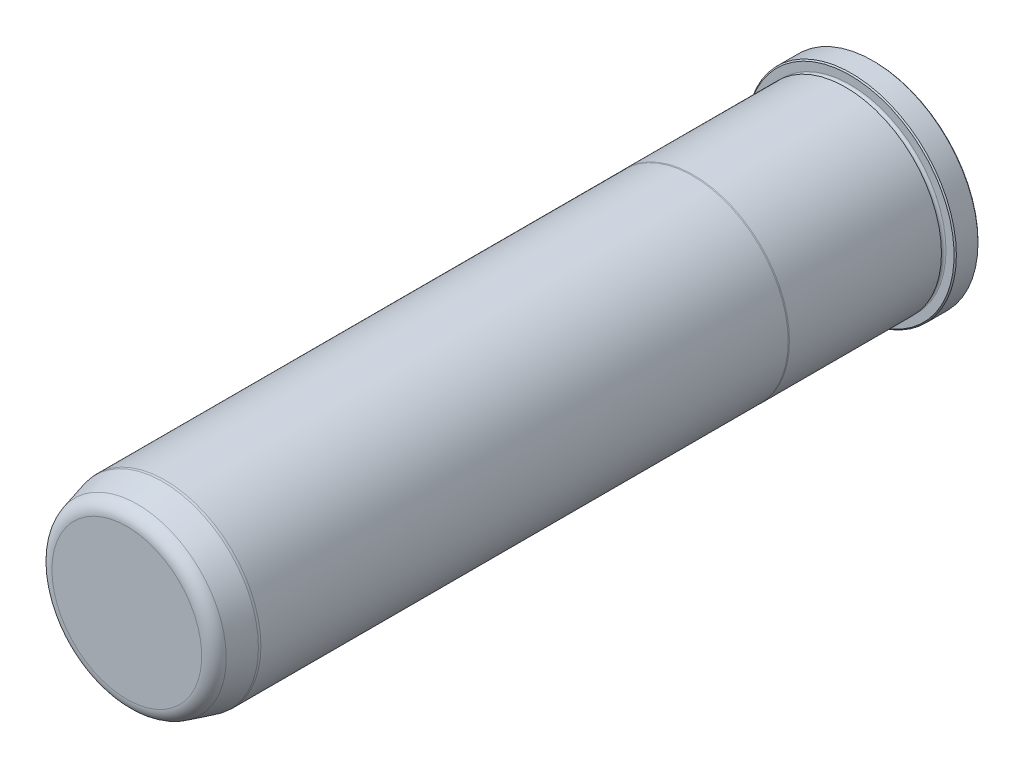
ISO-10303-21;
HEADER;
FILE_DESCRIPTION(('STEP AP214'),'2;1');
FILE_NAME('part.step','',(''),(''),'','','');
FILE_SCHEMA(('AUTOMOTIVE_DESIGN { 1 0 10303 214 1 1 1 1 }'));
ENDSEC;
DATA;
#1=APPLICATION_CONTEXT('core data for automotive mechanical design processes');
#2=APPLICATION_PROTOCOL_DEFINITION('international standard','automotive_design',2000,#1);
#3=PRODUCT_CONTEXT('',#1,'mechanical');
#4=PRODUCT('Part','Part','',(#3));
#5=PRODUCT_RELATED_PRODUCT_CATEGORY('part','',(#4));
#6=PRODUCT_DEFINITION_FORMATION('','',#4);
#7=PRODUCT_DEFINITION_CONTEXT('part definition',#1,'design');
#8=PRODUCT_DEFINITION('design','',#6,#7);
#9=PRODUCT_DEFINITION_SHAPE('','',#8);
#10=(LENGTH_UNIT() NAMED_UNIT(*) SI_UNIT(.MILLI.,.METRE.));
#11=(NAMED_UNIT(*) PLANE_ANGLE_UNIT() SI_UNIT($,.RADIAN.));
#12=(NAMED_UNIT(*) SI_UNIT($,.STERADIAN.) SOLID_ANGLE_UNIT());
#13=UNCERTAINTY_MEASURE_WITH_UNIT(LENGTH_MEASURE(1.E-05),#10,'distance_accuracy_value','');
#14=(GEOMETRIC_REPRESENTATION_CONTEXT(3) GLOBAL_UNCERTAINTY_ASSIGNED_CONTEXT((#13)) GLOBAL_UNIT_ASSIGNED_CONTEXT((#10,
#11,#12)) REPRESENTATION_CONTEXT('',''));
#15=CARTESIAN_POINT('',(0.,0.,0.));
#16=DIRECTION('',(0.,0.,1.));
#17=DIRECTION('',(1.,0.,0.));
#18=AXIS2_PLACEMENT_3D('',#15,#16,#17);
#19=CARTESIAN_POINT('',(0.,0.,0.));
#20=DIRECTION('',(0.,0.,1.));
#21=DIRECTION('',(1.,0.,0.));
#22=AXIS2_PLACEMENT_3D('',#19,#20,#21);
#23=PLANE('',#22);
#24=CARTESIAN_POINT('',(0.,0.,0.));
#25=DIRECTION('',(0.,0.,1.));
#26=DIRECTION('',(1.,0.,0.));
#27=AXIS2_PLACEMENT_3D('',#24,#25,#26);
#28=CIRCLE('',#27,34.417);
#29=CARTESIAN_POINT('',(34.417,0.,0.));
#30=VERTEX_POINT('',#29);
#31=EDGE_CURVE('E37',#30,#30,#28,.F.);
#32=ORIENTED_EDGE('',*,*,#31,.T.);
#33=EDGE_LOOP('',(#32));
#34=FACE_BOUND('',#33,.T.);
#35=ADVANCED_FACE('F30',(#34),#23,.F.);
#36=CARTESIAN_POINT('',(0.,0.,0.));
#37=DIRECTION('',(0.,0.,1.));
#38=DIRECTION('',(1.,0.,0.));
#39=AXIS2_PLACEMENT_3D('',#36,#37,#38);
#40=CYLINDRICAL_SURFACE('',#39,34.798);
#41=CARTESIAN_POINT('',(0.,0.,0.381000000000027));
#42=DIRECTION('',(0.,0.,1.));
#43=DIRECTION('',(1.,0.,0.));
#44=AXIS2_PLACEMENT_3D('',#41,#42,#43);
#45=CIRCLE('',#44,34.798);
#46=CARTESIAN_POINT('',(34.798,0.,0.381000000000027));
#47=VERTEX_POINT('',#46);
#48=EDGE_CURVE('E41',#47,#47,#45,.T.);
#49=ORIENTED_EDGE('',*,*,#48,.T.);
#50=EDGE_LOOP('',(#49));
#51=FACE_BOUND('',#50,.T.);
#52=CARTESIAN_POINT('',(0.,0.,7.54380000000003));
#53=DIRECTION('',(0.,0.,-1.));
#54=DIRECTION('',(-1.,0.,0.));
#55=AXIS2_PLACEMENT_3D('',#52,#53,#54);
#56=CIRCLE('',#55,34.798);
#57=CARTESIAN_POINT('',(-34.798,0.,7.54380000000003));
#58=VERTEX_POINT('',#57);
#59=EDGE_CURVE('E45',#58,#58,#56,.T.);
#60=ORIENTED_EDGE('',*,*,#59,.T.);
#61=EDGE_LOOP('',(#60));
#62=FACE_BOUND('',#61,.T.);
#63=ADVANCED_FACE('F118',(#51,#62),#40,.T.);
#64=CARTESIAN_POINT('',(0.,34.798,7.9248));
#65=DIRECTION('',(0.,0.,-1.));
#66=DIRECTION('',(-1.,0.,0.));
#67=AXIS2_PLACEMENT_3D('',#64,#65,#66);
#68=PLANE('',#67);
#69=CARTESIAN_POINT('',(0.,0.,7.9248));
#70=DIRECTION('',(0.,0.,-1.));
#71=DIRECTION('',(-1.,0.,0.));
#72=AXIS2_PLACEMENT_3D('',#69,#70,#71);
#73=CIRCLE('',#72,34.417);
#74=CARTESIAN_POINT('',(-34.417,0.,7.9248));
#75=VERTEX_POINT('',#74);
#76=EDGE_CURVE('E10',#75,#75,#73,.F.);
#77=ORIENTED_EDGE('',*,*,#76,.T.);
#78=EDGE_LOOP('',(#77));
#79=FACE_BOUND('',#78,.T.);
#80=CARTESIAN_POINT('',(0.,0.,7.9248));
#81=DIRECTION('',(0.,0.,1.));
#82=DIRECTION('',(1.,0.,0.));
#83=AXIS2_PLACEMENT_3D('',#80,#81,#82);
#84=CIRCLE('',#83,31.7373);
#85=CARTESIAN_POINT('',(31.7373,0.,7.9248));
#86=VERTEX_POINT('',#85);
#87=EDGE_CURVE('E56',#86,#86,#84,.T.);
#88=ORIENTED_EDGE('',*,*,#87,.F.);
#89=EDGE_LOOP('',(#88));
#90=FACE_BOUND('',#89,.T.);
#91=ADVANCED_FACE('F113',(#79,#90),#68,.F.);
#92=CARTESIAN_POINT('',(0.,0.,8.6868));
#93=DIRECTION('',(0.,0.,1.));
#94=DIRECTION('',(1.,0.,0.));
#95=AXIS2_PLACEMENT_3D('',#92,#93,#94);
#96=TOROIDAL_SURFACE('',#95,31.7373,0.761999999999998);
#97=CARTESIAN_POINT('',(0.,0.,9.44879999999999));
#98=DIRECTION('',(0.,0.,1.));
#99=DIRECTION('',(1.,0.,0.));
#100=AXIS2_PLACEMENT_3D('',#97,#98,#99);
#101=CIRCLE('',#100,31.7373);
#102=CARTESIAN_POINT('',(31.7373,0.,9.44879999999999));
#103=VERTEX_POINT('',#102);
#104=EDGE_CURVE('E59',#103,#103,#101,.T.);
#105=ORIENTED_EDGE('',*,*,#104,.F.);
#106=EDGE_LOOP('',(#105));
#107=FACE_BOUND('',#106,.T.);
#108=ORIENTED_EDGE('',*,*,#87,.T.);
#109=EDGE_LOOP('',(#108));
#110=FACE_BOUND('',#109,.T.);
#111=ADVANCED_FACE('F107',(#107,#110),#96,.F.);
#112=CARTESIAN_POINT('',(0.,31.7373,9.44879999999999));
#113=DIRECTION('',(0.,0.,1.));
#114=DIRECTION('',(1.,0.,0.));
#115=AXIS2_PLACEMENT_3D('',#112,#113,#114);
#116=PLANE('',#115);
#117=CARTESIAN_POINT('',(0.,0.,9.4488));
#118=DIRECTION('',(0.,0.,1.));
#119=DIRECTION('',(1.,0.,0.));
#120=AXIS2_PLACEMENT_3D('',#117,#118,#119);
#121=CIRCLE('',#120,31.7627);
#122=CARTESIAN_POINT('',(31.7627,0.,9.4488));
#123=VERTEX_POINT('',#122);
#124=EDGE_CURVE('E62',#123,#123,#121,.T.);
#125=ORIENTED_EDGE('',*,*,#124,.F.);
#126=EDGE_LOOP('',(#125));
#127=FACE_BOUND('',#126,.T.);
#128=ORIENTED_EDGE('',*,*,#104,.T.);
#129=EDGE_LOOP('',(#128));
#130=FACE_BOUND('',#129,.T.);
#131=ADVANCED_FACE('F101',(#127,#130),#116,.F.);
#132=CARTESIAN_POINT('',(0.,0.,0.));
#133=DIRECTION('',(0.,0.,1.));
#134=DIRECTION('',(1.,0.,0.));
#135=AXIS2_PLACEMENT_3D('',#132,#133,#134);
#136=CYLINDRICAL_SURFACE('',#135,31.7627);
#137=CARTESIAN_POINT('',(0.,0.,59.8347630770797));
#138=DIRECTION('',(0.,0.,1.));
#139=DIRECTION('',(1.,0.,0.));
#140=AXIS2_PLACEMENT_3D('',#137,#138,#139);
#141=CIRCLE('',#140,31.7627);
#142=CARTESIAN_POINT('',(31.7627,0.,59.8347630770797));
#143=VERTEX_POINT('',#142);
#144=EDGE_CURVE('E65',#143,#143,#141,.T.);
#145=ORIENTED_EDGE('',*,*,#144,.F.);
#146=EDGE_LOOP('',(#145));
#147=FACE_BOUND('',#146,.T.);
#148=ORIENTED_EDGE('',*,*,#124,.T.);
#149=EDGE_LOOP('',(#148));
#150=FACE_BOUND('',#149,.T.);
#151=ADVANCED_FACE('F95',(#147,#150),#136,.T.);
#152=CARTESIAN_POINT('',(0.,0.,59.8347630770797));
#153=DIRECTION('',(0.,0.,-1.));
#154=DIRECTION('',(-1.,0.,0.));
#155=AXIS2_PLACEMENT_3D('',#152,#153,#154);
#156=CONICAL_SURFACE('',#155,31.7627,0.0698131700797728);
#157=CARTESIAN_POINT('',(0.,0.,60.198));
#158=DIRECTION('',(0.,0.,1.));
#159=DIRECTION('',(1.,0.,0.));
#160=AXIS2_PLACEMENT_3D('',#157,#158,#159);
#161=CIRCLE('',#160,31.7373);
#162=CARTESIAN_POINT('',(31.7373,0.,60.198));
#163=VERTEX_POINT('',#162);
#164=EDGE_CURVE('E68',#163,#163,#161,.T.);
#165=ORIENTED_EDGE('',*,*,#164,.F.);
#166=EDGE_LOOP('',(#165));
#167=FACE_BOUND('',#166,.T.);
#168=ORIENTED_EDGE('',*,*,#144,.T.);
#169=EDGE_LOOP('',(#168));
#170=FACE_BOUND('',#169,.T.);
#171=ADVANCED_FACE('F89',(#167,#170),#156,.T.);
#172=CARTESIAN_POINT('',(0.,0.,0.));
#173=DIRECTION('',(0.,0.,1.));
#174=DIRECTION('',(1.,0.,0.));
#175=AXIS2_PLACEMENT_3D('',#172,#173,#174);
#176=CYLINDRICAL_SURFACE('',#175,31.7373);
#177=CARTESIAN_POINT('',(0.,0.,234.95));
#178=DIRECTION('',(0.,0.,1.));
#179=DIRECTION('',(1.,0.,0.));
#180=AXIS2_PLACEMENT_3D('',#177,#178,#179);
#181=CIRCLE('',#180,31.7373);
#182=CARTESIAN_POINT('',(31.7373,0.,234.95));
#183=VERTEX_POINT('',#182);
#184=EDGE_CURVE('E71',#183,#183,#181,.T.);
#185=ORIENTED_EDGE('',*,*,#184,.F.);
#186=EDGE_LOOP('',(#185));
#187=FACE_BOUND('',#186,.T.);
#188=ORIENTED_EDGE('',*,*,#164,.T.);
#189=EDGE_LOOP('',(#188));
#190=FACE_BOUND('',#189,.T.);
#191=ADVANCED_FACE('F83',(#187,#190),#176,.T.);
#192=CARTESIAN_POINT('',(0.,0.,234.95));
#193=DIRECTION('',(0.,0.,-1.));
#194=DIRECTION('',(-1.,0.,0.));
#195=AXIS2_PLACEMENT_3D('',#192,#193,#194);
#196=CONICAL_SURFACE('',#195,31.7373,0.0872664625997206);
#197=CARTESIAN_POINT('',(0.,0.,235.712));
#198=DIRECTION('',(0.,0.,1.));
#199=DIRECTION('',(1.,0.,0.));
#200=AXIS2_PLACEMENT_3D('',#197,#198,#199);
#201=CIRCLE('',#200,31.6706336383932);
#202=CARTESIAN_POINT('',(31.6706336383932,0.,235.712));
#203=VERTEX_POINT('',#202);
#204=EDGE_CURVE('E74',#203,#203,#201,.T.);
#205=ORIENTED_EDGE('',*,*,#204,.F.);
#206=EDGE_LOOP('',(#205));
#207=FACE_BOUND('',#206,.T.);
#208=ORIENTED_EDGE('',*,*,#184,.T.);
#209=EDGE_LOOP('',(#208));
#210=FACE_BOUND('',#209,.T.);
#211=ADVANCED_FACE('F80',(#207,#210),#196,.T.);
#212=CARTESIAN_POINT('',(0.,0.,235.712));
#213=DIRECTION('',(0.,0.,-1.));
#214=DIRECTION('',(-1.,0.,0.));
#215=AXIS2_PLACEMENT_3D('',#212,#213,#214);
#216=CONICAL_SURFACE('',#215,31.6706336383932,0.26179938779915);
#217=CARTESIAN_POINT('',(0.,0.,244.120125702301));
#218=DIRECTION('',(0.,0.,1.));
#219=DIRECTION('',(1.,0.,0.));
#220=AXIS2_PLACEMENT_3D('',#217,#218,#219);
#221=CIRCLE('',#220,29.4176831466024);
#222=CARTESIAN_POINT('',(29.4176831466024,0.,244.120125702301));
#223=VERTEX_POINT('',#222);
#224=EDGE_CURVE('E50',#223,#223,#221,.F.);
#225=ORIENTED_EDGE('',*,*,#224,.T.);
#226=EDGE_LOOP('',(#225));
#227=FACE_BOUND('',#226,.T.);
#228=ORIENTED_EDGE('',*,*,#204,.T.);
#229=EDGE_LOOP('',(#228));
#230=FACE_BOUND('',#229,.T.);
#231=ADVANCED_FACE('F78',(#227,#230),#216,.T.);
#232=CARTESIAN_POINT('',(0.,28.4718561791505,247.65));
#233=DIRECTION('',(0.,0.,-1.));
#234=DIRECTION('',(-1.,0.,0.));
#235=AXIS2_PLACEMENT_3D('',#232,#233,#234);
#236=PLANE('',#235);
#237=CARTESIAN_POINT('',(0.,0.,247.65));
#238=DIRECTION('',(0.,0.,-1.));
#239=DIRECTION('',(-1.,0.,0.));
#240=AXIS2_PLACEMENT_3D('',#237,#238,#239);
#241=CIRCLE('',#240,24.8174613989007);
#242=CARTESIAN_POINT('',(-24.8174613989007,0.,247.65));
#243=VERTEX_POINT('',#242);
#244=EDGE_CURVE('E53',#243,#243,#241,.F.);
#245=ORIENTED_EDGE('',*,*,#244,.T.);
#246=EDGE_LOOP('',(#245));
#247=FACE_BOUND('',#246,.T.);
#248=ADVANCED_FACE('F133',(#247),#236,.F.);
#249=CARTESIAN_POINT('',(0.,0.,242.8875));
#250=DIRECTION('',(0.,0.,-1.));
#251=DIRECTION('',(-1.,0.,0.));
#252=AXIS2_PLACEMENT_3D('',#249,#250,#251);
#253=TOROIDAL_SURFACE('',#252,24.8174613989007,4.7625);
#254=ORIENTED_EDGE('',*,*,#224,.F.);
#255=EDGE_LOOP('',(#254));
#256=FACE_BOUND('',#255,.T.);
#257=ORIENTED_EDGE('',*,*,#244,.F.);
#258=EDGE_LOOP('',(#257));
#259=FACE_BOUND('',#258,.T.);
#260=ADVANCED_FACE('F130',(#256,#259),#253,.T.);
#261=CARTESIAN_POINT('',(0.,0.,0.381000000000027));
#262=DIRECTION('',(0.,0.,1.));
#263=DIRECTION('',(1.,0.,0.));
#264=AXIS2_PLACEMENT_3D('',#261,#262,#263);
#265=CONICAL_SURFACE('',#264,34.798,0.785398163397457);
#266=ORIENTED_EDGE('',*,*,#31,.F.);
#267=EDGE_LOOP('',(#266));
#268=FACE_BOUND('',#267,.T.);
#269=ORIENTED_EDGE('',*,*,#48,.F.);
#270=EDGE_LOOP('',(#269));
#271=FACE_BOUND('',#270,.T.);
#272=ADVANCED_FACE('F132',(#268,#271),#265,.T.);
#273=CARTESIAN_POINT('',(0.,0.,7.9248));
#274=DIRECTION('',(0.,0.,-1.));
#275=DIRECTION('',(-1.,0.,0.));
#276=AXIS2_PLACEMENT_3D('',#273,#274,#275);
#277=CONICAL_SURFACE('',#276,34.417,0.785398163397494);
#278=ORIENTED_EDGE('',*,*,#59,.F.);
#279=EDGE_LOOP('',(#278));
#280=FACE_BOUND('',#279,.T.);
#281=ORIENTED_EDGE('',*,*,#76,.F.);
#282=EDGE_LOOP('',(#281));
#283=FACE_BOUND('',#282,.T.);
#284=ADVANCED_FACE('F32',(#280,#283),#277,.T.);
#285=CLOSED_SHELL('',(#35,#63,#91,#111,#131,#151,#171,#191,#211,#231,#248,#260,#272,#284));
#286=MANIFOLD_SOLID_BREP('B2',#285);
#287=ADVANCED_BREP_SHAPE_REPRESENTATION('',(#18,#286),#14);
#288=SHAPE_DEFINITION_REPRESENTATION(#9,#287);
ENDSEC;
END-ISO-10303-21;
